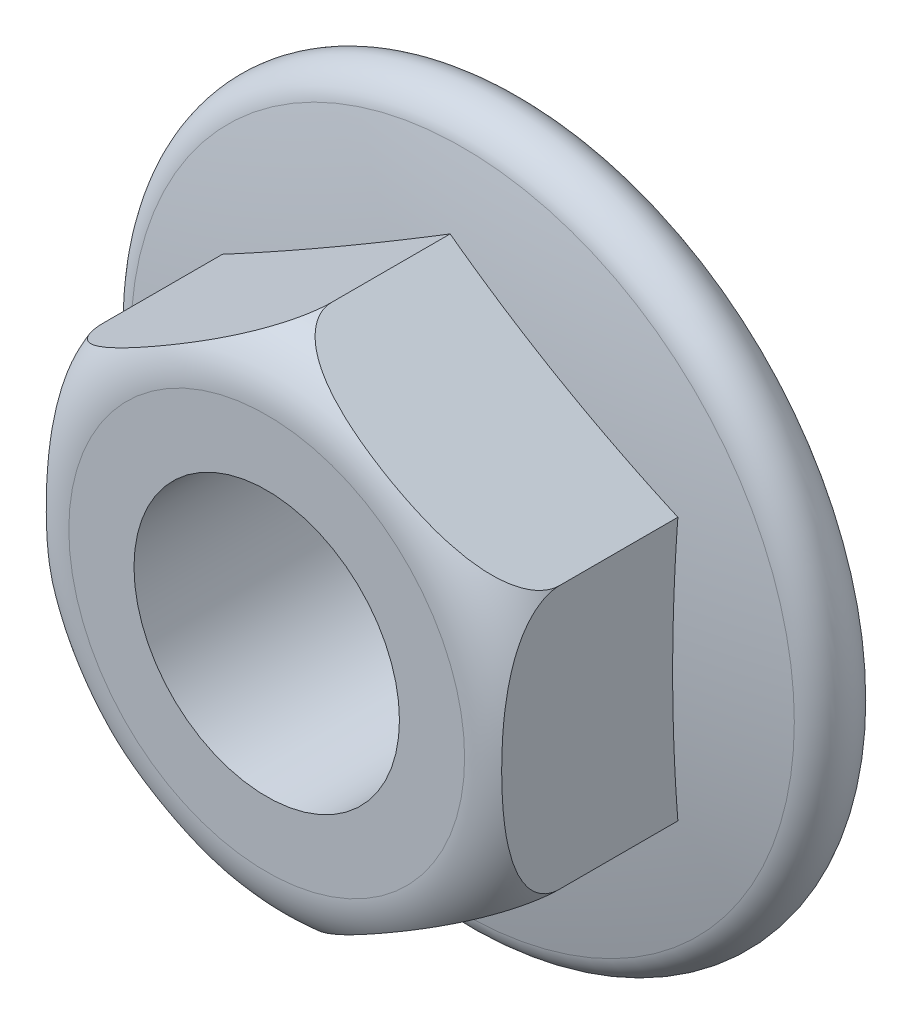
from build123d import *

# Parameters (mm, degrees)
HEAD_DEPTH         = 4
HOLE_SKETCH_R      = 2.04
THROUGH_HOLE_DEPTH = 9.746427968


with BuildPart() as part:
    # Head Sketch → Head (new body)
    with BuildSketch(Plane.XY):
        Polygon((0, 4.041451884), (3.5, 2.020725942), (3.5, -2.020725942), (0, -4.041451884), (-3.5, -2.020725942), (-3.5, 2.020725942), align=None)
    extrude(amount=HEAD_DEPTH)

    # Flange Sketch → Flange (revolve)
    with BuildSketch(Plane(origin=(0, 0, 0), x_dir=(-1, 0, 0), z_dir=(0, 1, 0)), mode=Mode.PRIVATE) as flange_sk:
        with BuildLine():
            Line((-5, 0), (0, 0))
            Line((0, 0), (0, 1.5))
            ThreePointArc((0, 1.5), (-2.562220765, 1.372207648), (-5.099009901, 0.99009901))
            ThreePointArc((-5.099009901, 0.99009901), (-5.497518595, 0.45024814), (-5, 0))
        make_face()
    revolve(flange_sk.sketch.rotate(Axis((0, 0, 1.843425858), (0, 0, -1)), 210), axis=Axis((0, 0, 1.843425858), (0, 0, -1)))

    # Sketch5 → Head Trim (revolve, cut)
    with BuildSketch(Plane(origin=(0, 0, 0), x_dir=(0, 0, -1), z_dir=(1, 0, 0)), mode=Mode.PRIVATE) as head_trim_sk:
        with BuildLine():
            Line((-4, -3.041451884), (-4, -4.041451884))
            Line((-4, -4.041451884), (-3, -4.041451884))
            ThreePointArc((-3, -4.041451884), (-3.707106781, -3.748558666), (-4, -3.041451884))
        make_face()
    revolve(head_trim_sk.sketch.rotate(Axis((0, 0, 15.085599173), (0, 0, -1)), 270), axis=Axis((0, 0, 15.085599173), (0, 0, -1)), mode=Mode.SUBTRACT)

    # Hole Sketch → Through Hole (cut, through all)
    with BuildSketch(Plane.XY.offset(4)):
        Circle(HOLE_SKETCH_R)
    extrude(amount=-THROUGH_HOLE_DEPTH, mode=Mode.SUBTRACT)


solid = part.part
